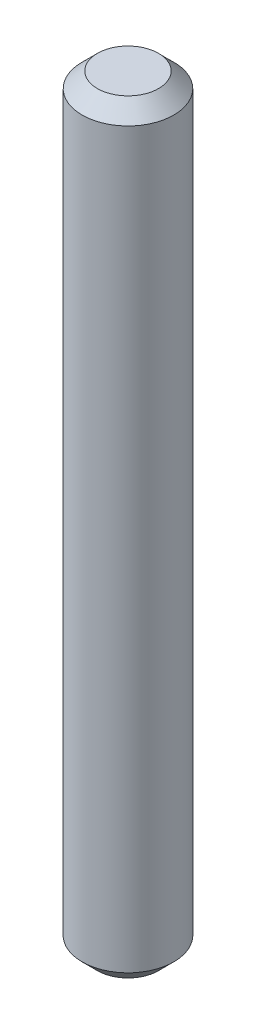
ISO-10303-21;
HEADER;
FILE_DESCRIPTION(('STEP AP214'),'2;1');
FILE_NAME('part.step','',(''),(''),'','','');
FILE_SCHEMA(('AUTOMOTIVE_DESIGN { 1 0 10303 214 1 1 1 1 }'));
ENDSEC;
DATA;
#1=APPLICATION_CONTEXT('core data for automotive mechanical design processes');
#2=APPLICATION_PROTOCOL_DEFINITION('international standard','automotive_design',2000,#1);
#3=PRODUCT_CONTEXT('',#1,'mechanical');
#4=PRODUCT('Part','Part','',(#3));
#5=PRODUCT_RELATED_PRODUCT_CATEGORY('part','',(#4));
#6=PRODUCT_DEFINITION_FORMATION('','',#4);
#7=PRODUCT_DEFINITION_CONTEXT('part definition',#1,'design');
#8=PRODUCT_DEFINITION('design','',#6,#7);
#9=PRODUCT_DEFINITION_SHAPE('','',#8);
#10=(LENGTH_UNIT() NAMED_UNIT(*) SI_UNIT(.MILLI.,.METRE.));
#11=(NAMED_UNIT(*) PLANE_ANGLE_UNIT() SI_UNIT($,.RADIAN.));
#12=(NAMED_UNIT(*) SI_UNIT($,.STERADIAN.) SOLID_ANGLE_UNIT());
#13=UNCERTAINTY_MEASURE_WITH_UNIT(LENGTH_MEASURE(1.E-05),#10,'distance_accuracy_value','');
#14=(GEOMETRIC_REPRESENTATION_CONTEXT(3) GLOBAL_UNCERTAINTY_ASSIGNED_CONTEXT((#13)) GLOBAL_UNIT_ASSIGNED_CONTEXT((#10,
#11,#12)) REPRESENTATION_CONTEXT('',''));
#15=CARTESIAN_POINT('',(0.,0.,0.));
#16=DIRECTION('',(0.,0.,1.));
#17=DIRECTION('',(1.,0.,0.));
#18=AXIS2_PLACEMENT_3D('',#15,#16,#17);
#19=CARTESIAN_POINT('',(0.,50.,0.));
#20=DIRECTION('',(0.,-1.,0.));
#21=DIRECTION('',(0.,0.,-1.));
#22=AXIS2_PLACEMENT_3D('',#19,#20,#21);
#23=CYLINDRICAL_SURFACE('',#22,3.);
#24=CARTESIAN_POINT('',(0.,49.,0.));
#25=DIRECTION('',(0.,1.,0.));
#26=DIRECTION('',(0.,0.,1.));
#27=AXIS2_PLACEMENT_3D('',#24,#25,#26);
#28=CIRCLE('',#27,3.);
#29=CARTESIAN_POINT('',(0.,49.,3.));
#30=VERTEX_POINT('',#29);
#31=EDGE_CURVE('E31',#30,#30,#28,.F.);
#32=ORIENTED_EDGE('',*,*,#31,.T.);
#33=EDGE_LOOP('',(#32));
#34=FACE_BOUND('',#33,.T.);
#35=CARTESIAN_POINT('',(0.,1.00000000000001,0.));
#36=DIRECTION('',(0.,1.,0.));
#37=DIRECTION('',(0.,0.,1.));
#38=AXIS2_PLACEMENT_3D('',#35,#36,#37);
#39=CIRCLE('',#38,3.);
#40=CARTESIAN_POINT('',(0.,1.00000000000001,3.));
#41=VERTEX_POINT('',#40);
#42=EDGE_CURVE('E35',#41,#41,#39,.T.);
#43=ORIENTED_EDGE('',*,*,#42,.T.);
#44=EDGE_LOOP('',(#43));
#45=FACE_BOUND('',#44,.T.);
#46=ADVANCED_FACE('F25',(#34,#45),#23,.T.);
#47=CARTESIAN_POINT('',(0.,50.,0.));
#48=DIRECTION('',(0.,1.,0.));
#49=DIRECTION('',(0.,0.,1.));
#50=AXIS2_PLACEMENT_3D('',#47,#48,#49);
#51=PLANE('',#50);
#52=CARTESIAN_POINT('',(0.,50.,0.));
#53=DIRECTION('',(0.,1.,0.));
#54=DIRECTION('',(0.,0.,1.));
#55=AXIS2_PLACEMENT_3D('',#52,#53,#54);
#56=CIRCLE('',#55,2.00000000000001);
#57=CARTESIAN_POINT('',(0.,50.,2.00000000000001));
#58=VERTEX_POINT('',#57);
#59=EDGE_CURVE('E39',#58,#58,#56,.T.);
#60=ORIENTED_EDGE('',*,*,#59,.T.);
#61=EDGE_LOOP('',(#60));
#62=FACE_BOUND('',#61,.T.);
#63=ADVANCED_FACE('F45',(#62),#51,.T.);
#64=CARTESIAN_POINT('',(0.,0.,0.));
#65=DIRECTION('',(0.,1.,0.));
#66=DIRECTION('',(0.,0.,1.));
#67=AXIS2_PLACEMENT_3D('',#64,#65,#66);
#68=PLANE('',#67);
#69=CARTESIAN_POINT('',(0.,0.,0.));
#70=DIRECTION('',(0.,1.,0.));
#71=DIRECTION('',(0.,0.,1.));
#72=AXIS2_PLACEMENT_3D('',#69,#70,#71);
#73=CIRCLE('',#72,1.99999999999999);
#74=CARTESIAN_POINT('',(0.,0.,1.99999999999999));
#75=VERTEX_POINT('',#74);
#76=EDGE_CURVE('E10',#75,#75,#73,.F.);
#77=ORIENTED_EDGE('',*,*,#76,.T.);
#78=EDGE_LOOP('',(#77));
#79=FACE_BOUND('',#78,.T.);
#80=ADVANCED_FACE('F50',(#79),#68,.F.);
#81=CARTESIAN_POINT('',(0.,50.,0.));
#82=DIRECTION('',(0.,-1.,0.));
#83=DIRECTION('',(0.,0.,-1.));
#84=AXIS2_PLACEMENT_3D('',#81,#82,#83);
#85=CONICAL_SURFACE('',#84,2.00000000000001,0.785398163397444);
#86=ORIENTED_EDGE('',*,*,#31,.F.);
#87=EDGE_LOOP('',(#86));
#88=FACE_BOUND('',#87,.T.);
#89=ORIENTED_EDGE('',*,*,#59,.F.);
#90=EDGE_LOOP('',(#89));
#91=FACE_BOUND('',#90,.T.);
#92=ADVANCED_FACE('F47',(#88,#91),#85,.T.);
#93=CARTESIAN_POINT('',(0.,1.00000000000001,0.));
#94=DIRECTION('',(0.,1.,0.));
#95=DIRECTION('',(0.,0.,1.));
#96=AXIS2_PLACEMENT_3D('',#93,#94,#95);
#97=CONICAL_SURFACE('',#96,3.,0.785398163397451);
#98=ORIENTED_EDGE('',*,*,#76,.F.);
#99=EDGE_LOOP('',(#98));
#100=FACE_BOUND('',#99,.T.);
#101=ORIENTED_EDGE('',*,*,#42,.F.);
#102=EDGE_LOOP('',(#101));
#103=FACE_BOUND('',#102,.T.);
#104=ADVANCED_FACE('F49',(#100,#103),#97,.T.);
#105=CLOSED_SHELL('',(#46,#63,#80,#92,#104));
#106=MANIFOLD_SOLID_BREP('B2',#105);
#107=ADVANCED_BREP_SHAPE_REPRESENTATION('',(#18,#106),#14);
#108=SHAPE_DEFINITION_REPRESENTATION(#9,#107);
ENDSEC;
END-ISO-10303-21;
